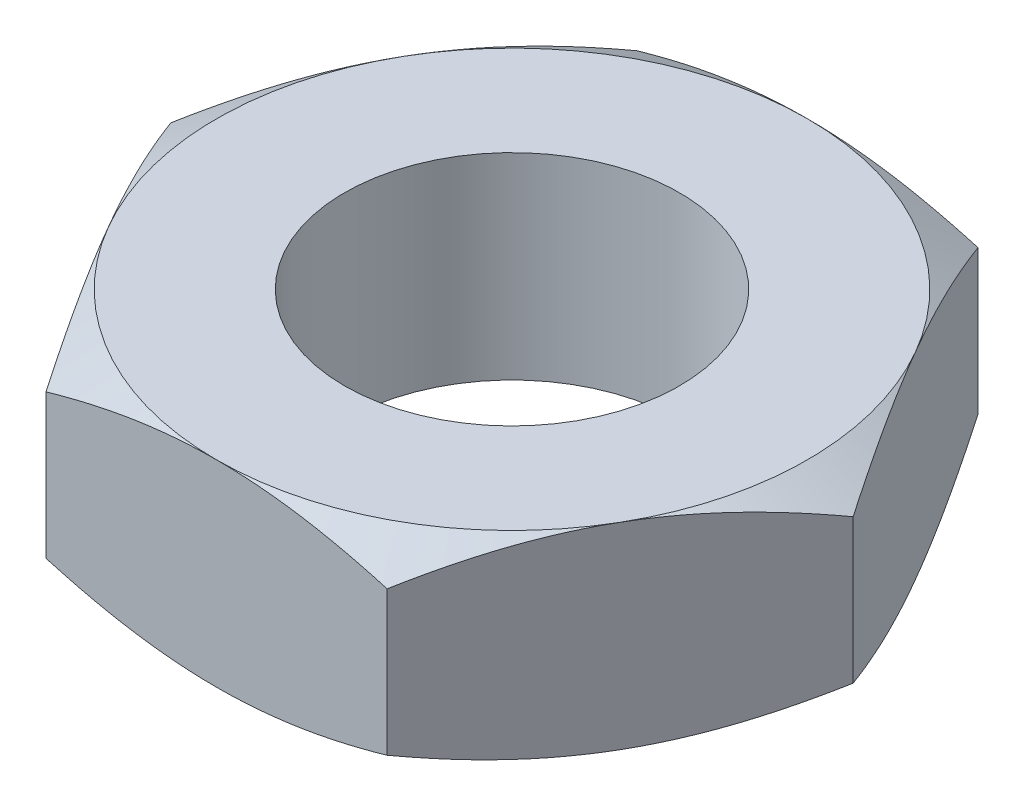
from build123d import *

# Parameters (mm, degrees)
EXTRUDE1_DEPTH          = 3
M12X1_75_TAPPED_HOLE1_D = 10.2
SKETCH4_OUTSIDE_W       = 83.838
SKETCH4_OUTSIDE_H       = 81.054
SKETCH4_OUTSIDE_R       = 9
CUT_EXTRUDE1_DEPTH      = 16
CUT_EXTRUDE1_DRAFT      = -60
MIRROR1_COPY_1_SKETCH_W = 83.838
MIRROR1_COPY_1_SKETCH_H = 81.054
MIRROR1_COPY_1_SKETCH_R = 9
MIRROR1_COPY_1_DEPTH    = 16
MIRROR1_COPY_1_DRAFT    = -60


with BuildPart() as part:
    # Sketch1 → Extrude1 (new, symmetric)
    with BuildSketch(Plane(origin=(0, 0, 0), x_dir=(1, 0, 0), z_dir=(0, 1, 0))):
        Polygon((10.392304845, 0), (5.196152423, 9), (-5.196152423, 9), (-10.392304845, 0), (-5.196152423, -9), (5.196152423, -9), align=None)
    extrude(amount=EXTRUDE1_DEPTH, both=True)

    # M12x1.75 Tapped Hole1 (through all)
    with Locations(Plane(origin=(0, 3, 0), x_dir=(1, 0, 0), z_dir=(0, 1, 0))):
        with Locations((0, 0)):
            Hole(M12X1_75_TAPPED_HOLE1_D / 2)


with BuildPart() as cut_extrude1_tool:
    # Sketch4 outside → Cut-Extrude1 (with draft: the straight prism first)
    with BuildSketch(Plane(origin=(0, 3, 0), x_dir=(1, 0, 0), z_dir=(0, 1, 0))):
        Rectangle(SKETCH4_OUTSIDE_W, SKETCH4_OUTSIDE_H)
        Circle(SKETCH4_OUTSIDE_R, mode=Mode.SUBTRACT)
    extrude(amount=-CUT_EXTRUDE1_DEPTH)
    # Cut-Extrude1: the draft: its side faces are tilted about the plane it starts from
    cut_extrude1_sides = [cut_extrude1_tool.faces().sort_by_distance(p)[0] for p in [
        (0, -5, 40.527),
        (41.919, -5, 0),
        (0, -5, -40.527),
        (-41.919, -5, 0),
        (-9, -5, 0),
    ]]
    draft(cut_extrude1_sides, Plane(origin=(0, 3, 0), x_dir=(1, 0, 0), z_dir=(0, 1, 0)), CUT_EXTRUDE1_DRAFT)


with BuildPart() as part_1:
    add(part.part)

    # Cut-Extrude1: cut by cut_extrude1_tool
    add(cut_extrude1_tool.part, mode=Mode.SUBTRACT)


with BuildPart() as mirror1_copy_1_tool:
    # Mirror1 copy 1 sketch → Mirror1 copy 1 (with draft: the straight prism first)
    with BuildSketch(Plane.XZ.offset(3)):
        Rectangle(MIRROR1_COPY_1_SKETCH_W, MIRROR1_COPY_1_SKETCH_H)
        Circle(MIRROR1_COPY_1_SKETCH_R, mode=Mode.SUBTRACT)
    extrude(amount=-MIRROR1_COPY_1_DEPTH)
    # Mirror1 copy 1: the draft: its side faces are tilted about the plane it starts from
    mirror1_copy_1_sides = [mirror1_copy_1_tool.faces().sort_by_distance(p)[0] for p in [
        (0, 5, 40.527),
        (41.919, 5, 0),
        (0, 5, -40.527),
        (-41.919, 5, 0),
        (-9, 5, 0),
    ]]
    draft(mirror1_copy_1_sides, Plane.XZ.offset(3), MIRROR1_COPY_1_DRAFT)


with BuildPart() as part_2:
    add(part_1.part)

    # Mirror1 copy 1: cut by mirror1_copy_1_tool
    add(mirror1_copy_1_tool.part, mode=Mode.SUBTRACT)


solid = part_2.part
